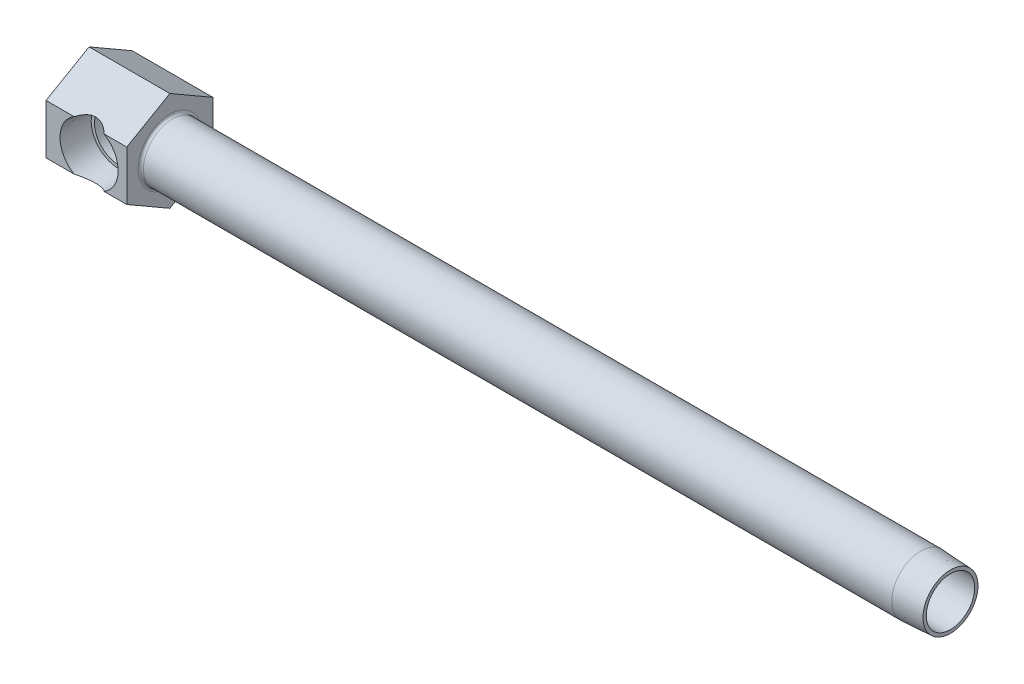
ISO-10303-21;
HEADER;
FILE_DESCRIPTION(('STEP AP214'),'2;1');
FILE_NAME('part.step','',(''),(''),'','','');
FILE_SCHEMA(('AUTOMOTIVE_DESIGN { 1 0 10303 214 1 1 1 1 }'));
ENDSEC;
DATA;
#1=APPLICATION_CONTEXT('core data for automotive mechanical design processes');
#2=APPLICATION_PROTOCOL_DEFINITION('international standard','automotive_design',2000,#1);
#3=PRODUCT_CONTEXT('',#1,'mechanical');
#4=PRODUCT('Part','Part','',(#3));
#5=PRODUCT_RELATED_PRODUCT_CATEGORY('part','',(#4));
#6=PRODUCT_DEFINITION_FORMATION('','',#4);
#7=PRODUCT_DEFINITION_CONTEXT('part definition',#1,'design');
#8=PRODUCT_DEFINITION('design','',#6,#7);
#9=PRODUCT_DEFINITION_SHAPE('','',#8);
#10=(LENGTH_UNIT() NAMED_UNIT(*) SI_UNIT(.MILLI.,.METRE.));
#11=(NAMED_UNIT(*) PLANE_ANGLE_UNIT() SI_UNIT($,.RADIAN.));
#12=(NAMED_UNIT(*) SI_UNIT($,.STERADIAN.) SOLID_ANGLE_UNIT());
#13=UNCERTAINTY_MEASURE_WITH_UNIT(LENGTH_MEASURE(1.E-05),#10,'distance_accuracy_value','');
#14=(GEOMETRIC_REPRESENTATION_CONTEXT(3) GLOBAL_UNCERTAINTY_ASSIGNED_CONTEXT((#13)) GLOBAL_UNIT_ASSIGNED_CONTEXT((#10,
#11,#12)) REPRESENTATION_CONTEXT('',''));
#15=CARTESIAN_POINT('',(0.,0.,0.));
#16=DIRECTION('',(0.,0.,1.));
#17=DIRECTION('',(1.,0.,0.));
#18=AXIS2_PLACEMENT_3D('',#15,#16,#17);
#19=CARTESIAN_POINT('',(254.,0.,12.7));
#20=DIRECTION('',(-1.,0.,0.));
#21=DIRECTION('',(0.,-1.,0.));
#22=AXIS2_PLACEMENT_3D('',#19,#20,#21);
#23=CYLINDRICAL_SURFACE('',#22,8.5725);
#24=CARTESIAN_POINT('',(24.5999,0.,12.7));
#25=DIRECTION('',(-1.,0.,0.));
#26=DIRECTION('',(0.,-1.,0.));
#27=AXIS2_PLACEMENT_3D('',#24,#25,#26);
#28=CIRCLE('',#27,8.5725);
#29=CARTESIAN_POINT('',(24.5999,-8.57249999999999,12.7));
#30=VERTEX_POINT('',#29);
#31=EDGE_CURVE('E283',#30,#30,#28,.F.);
#32=ORIENTED_EDGE('',*,*,#31,.T.);
#33=EDGE_LOOP('',(#32));
#34=FACE_BOUND('',#33,.T.);
#35=CARTESIAN_POINT('',(245.262399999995,0.,12.7000000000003));
#36=DIRECTION('',(-1.,0.,0.));
#37=DIRECTION('',(0.,0.,1.));
#38=AXIS2_PLACEMENT_3D('',#35,#36,#37);
#39=CIRCLE('',#38,8.5725);
#40=CARTESIAN_POINT('',(245.262399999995,0.,21.2725000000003));
#41=VERTEX_POINT('',#40);
#42=EDGE_CURVE('E137',#41,#41,#39,.T.);
#43=ORIENTED_EDGE('',*,*,#42,.T.);
#44=EDGE_LOOP('',(#43));
#45=FACE_BOUND('',#44,.T.);
#46=ADVANCED_FACE('F15',(#34,#45),#23,.T.);
#47=CARTESIAN_POINT('',(23.8125,14.6646968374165,12.7));
#48=DIRECTION('',(0.,-0.866025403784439,-0.5));
#49=DIRECTION('',(0.,0.5,-0.866025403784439));
#50=AXIS2_PLACEMENT_3D('',#47,#48,#49);
#51=PLANE('',#50);
#52=CARTESIAN_POINT('',(12.7,-0.84553451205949,39.56450873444));
#53=DIRECTION('',(0.,-0.866025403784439,-0.5));
#54=DIRECTION('',(0.,-0.5,0.866025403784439));
#55=AXIS2_PLACEMENT_3D('',#52,#53,#54);
#56=ELLIPSE('',#55,18.6296608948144,9.27637524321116);
#57=CARTESIAN_POINT('',(17.1412186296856,7.33234841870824,25.4));
#58=VERTEX_POINT('',#57);
#59=CARTESIAN_POINT('',(8.25878137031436,7.33234841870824,25.4));
#60=VERTEX_POINT('',#59);
#61=EDGE_CURVE('E255',#58,#60,#56,.F.);
#62=ORIENTED_EDGE('',*,*,#61,.F.);
#63=DIRECTION('',(-1.,0.,0.));
#64=VECTOR('',#63,1.);
#65=CARTESIAN_POINT('',(23.8125,7.33234841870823,25.4));
#66=LINE('',#65,#64);
#67=CARTESIAN_POINT('',(23.8125,7.33234841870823,25.4));
#68=VERTEX_POINT('',#67);
#69=EDGE_CURVE('E275',#68,#58,#66,.T.);
#70=ORIENTED_EDGE('',*,*,#69,.F.);
#71=DIRECTION('',(0.,-0.5,0.866025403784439));
#72=VECTOR('',#71,1.);
#73=CARTESIAN_POINT('',(23.8125,14.6646968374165,12.7));
#74=LINE('',#73,#72);
#75=CARTESIAN_POINT('',(23.8125,14.6646968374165,12.7));
#76=VERTEX_POINT('',#75);
#77=EDGE_CURVE('E259',#76,#68,#74,.T.);
#78=ORIENTED_EDGE('',*,*,#77,.F.);
#79=DIRECTION('',(-1.,0.,0.));
#80=VECTOR('',#79,1.);
#81=CARTESIAN_POINT('',(23.8125,14.6646968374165,12.7));
#82=LINE('',#81,#80);
#83=CARTESIAN_POINT('',(0.,14.6646968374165,12.7));
#84=VERTEX_POINT('',#83);
#85=EDGE_CURVE('E231',#76,#84,#82,.T.);
#86=ORIENTED_EDGE('',*,*,#85,.T.);
#87=DIRECTION('',(0.,-0.5,0.866025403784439));
#88=VECTOR('',#87,1.);
#89=CARTESIAN_POINT('',(0.,14.6646968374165,12.7));
#90=LINE('',#89,#88);
#91=CARTESIAN_POINT('',(0.,7.33234841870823,25.4));
#92=VERTEX_POINT('',#91);
#93=EDGE_CURVE('E236',#84,#92,#90,.T.);
#94=ORIENTED_EDGE('',*,*,#93,.T.);
#95=EDGE_CURVE('E274',#60,#92,#66,.T.);
#96=ORIENTED_EDGE('',*,*,#95,.F.);
#97=EDGE_LOOP('',(#62,#70,#78,#86,#94,#96));
#98=FACE_BOUND('',#97,.T.);
#99=ADVANCED_FACE('F172',(#98),#51,.F.);
#100=CARTESIAN_POINT('',(23.8125,7.33234841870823,25.4));
#101=DIRECTION('',(0.,0.,-1.));
#102=DIRECTION('',(-1.,0.,0.));
#103=AXIS2_PLACEMENT_3D('',#100,#101,#102);
#104=PLANE('',#103);
#105=CARTESIAN_POINT('',(12.7,0.,25.4));
#106=DIRECTION('',(0.,0.,-1.));
#107=DIRECTION('',(-1.,0.,0.));
#108=AXIS2_PLACEMENT_3D('',#105,#106,#107);
#109=CIRCLE('',#108,8.5725);
#110=CARTESIAN_POINT('',(17.1412186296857,-7.33234841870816,25.4));
#111=VERTEX_POINT('',#110);
#112=EDGE_CURVE('E284',#58,#111,#109,.T.);
#113=ORIENTED_EDGE('',*,*,#112,.T.);
#114=DIRECTION('',(-1.,0.,0.));
#115=VECTOR('',#114,1.);
#116=CARTESIAN_POINT('',(23.8125,-7.33234841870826,25.4));
#117=LINE('',#116,#115);
#118=CARTESIAN_POINT('',(23.8125,-7.33234841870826,25.4));
#119=VERTEX_POINT('',#118);
#120=EDGE_CURVE('E271',#119,#111,#117,.T.);
#121=ORIENTED_EDGE('',*,*,#120,.F.);
#122=DIRECTION('',(0.,-1.,0.));
#123=VECTOR('',#122,1.);
#124=CARTESIAN_POINT('',(23.8125,7.33234841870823,25.4));
#125=LINE('',#124,#123);
#126=EDGE_CURVE('E261',#68,#119,#125,.T.);
#127=ORIENTED_EDGE('',*,*,#126,.F.);
#128=ORIENTED_EDGE('',*,*,#69,.T.);
#129=EDGE_LOOP('',(#113,#121,#127,#128));
#130=FACE_BOUND('',#129,.T.);
#131=ADVANCED_FACE('F179',(#130),#104,.F.);
#132=CARTESIAN_POINT('',(8.25878137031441,-7.33234841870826,25.4));
#133=VERTEX_POINT('',#132);
#134=EDGE_CURVE('E38',#133,#60,#109,.T.);
#135=ORIENTED_EDGE('',*,*,#134,.T.);
#136=ORIENTED_EDGE('',*,*,#95,.T.);
#137=DIRECTION('',(0.,-1.,0.));
#138=VECTOR('',#137,1.);
#139=CARTESIAN_POINT('',(0.,7.33234841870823,25.4));
#140=LINE('',#139,#138);
#141=CARTESIAN_POINT('',(0.,-7.33234841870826,25.4));
#142=VERTEX_POINT('',#141);
#143=EDGE_CURVE('E242',#92,#142,#140,.T.);
#144=ORIENTED_EDGE('',*,*,#143,.T.);
#145=EDGE_CURVE('E270',#133,#142,#117,.T.);
#146=ORIENTED_EDGE('',*,*,#145,.F.);
#147=EDGE_LOOP('',(#135,#136,#144,#146));
#148=FACE_BOUND('',#147,.T.);
#149=ADVANCED_FACE('F198',(#148),#104,.F.);
#150=CARTESIAN_POINT('',(23.8125,-7.33234841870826,25.4));
#151=DIRECTION('',(0.,0.86602540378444,-0.5));
#152=DIRECTION('',(0.,0.5,0.86602540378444));
#153=AXIS2_PLACEMENT_3D('',#150,#151,#152);
#154=PLANE('',#153);
#155=CARTESIAN_POINT('',(12.7,0.845534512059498,39.5645087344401));
#156=DIRECTION('',(0.,0.86602540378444,-0.5));
#157=DIRECTION('',(0.,0.5,0.86602540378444));
#158=AXIS2_PLACEMENT_3D('',#155,#156,#157);
#159=ELLIPSE('',#158,18.6296608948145,9.27637524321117);
#160=EDGE_CURVE('E23',#133,#111,#159,.F.);
#161=ORIENTED_EDGE('',*,*,#160,.F.);
#162=ORIENTED_EDGE('',*,*,#145,.T.);
#163=DIRECTION('',(0.,-0.5,-0.86602540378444));
#164=VECTOR('',#163,1.);
#165=CARTESIAN_POINT('',(0.,-7.33234841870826,25.4));
#166=LINE('',#165,#164);
#167=CARTESIAN_POINT('',(0.,-14.6646968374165,12.7));
#168=VERTEX_POINT('',#167);
#169=EDGE_CURVE('E249',#142,#168,#166,.T.);
#170=ORIENTED_EDGE('',*,*,#169,.T.);
#171=DIRECTION('',(-1.,0.,0.));
#172=VECTOR('',#171,1.);
#173=CARTESIAN_POINT('',(23.8125,-14.6646968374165,12.7));
#174=LINE('',#173,#172);
#175=CARTESIAN_POINT('',(23.8125,-14.6646968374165,12.7));
#176=VERTEX_POINT('',#175);
#177=EDGE_CURVE('E265',#176,#168,#174,.T.);
#178=ORIENTED_EDGE('',*,*,#177,.F.);
#179=DIRECTION('',(0.,-0.5,-0.86602540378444));
#180=VECTOR('',#179,1.);
#181=CARTESIAN_POINT('',(23.8125,-7.33234841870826,25.4));
#182=LINE('',#181,#180);
#183=EDGE_CURVE('E263',#119,#176,#182,.T.);
#184=ORIENTED_EDGE('',*,*,#183,.F.);
#185=ORIENTED_EDGE('',*,*,#120,.T.);
#186=EDGE_LOOP('',(#161,#162,#170,#178,#184,#185));
#187=FACE_BOUND('',#186,.T.);
#188=ADVANCED_FACE('F195',(#187),#154,.F.);
#189=CARTESIAN_POINT('',(23.8125,-14.6646968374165,12.7));
#190=DIRECTION('',(0.,0.866025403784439,0.5));
#191=DIRECTION('',(0.,-0.5,0.866025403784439));
#192=AXIS2_PLACEMENT_3D('',#189,#190,#191);
#193=PLANE('',#192);
#194=DIRECTION('',(0.,0.5,-0.866025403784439));
#195=VECTOR('',#194,1.);
#196=CARTESIAN_POINT('',(0.,-14.6646968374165,12.7));
#197=LINE('',#196,#195);
#198=CARTESIAN_POINT('',(0.,-7.33234841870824,0.));
#199=VERTEX_POINT('',#198);
#200=EDGE_CURVE('E226',#168,#199,#197,.T.);
#201=ORIENTED_EDGE('',*,*,#200,.T.);
#202=DIRECTION('',(-1.,0.,0.));
#203=VECTOR('',#202,1.);
#204=CARTESIAN_POINT('',(23.8125,-7.33234841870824,0.));
#205=LINE('',#204,#203);
#206=CARTESIAN_POINT('',(23.8125,-7.33234841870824,0.));
#207=VERTEX_POINT('',#206);
#208=EDGE_CURVE('E220',#207,#199,#205,.T.);
#209=ORIENTED_EDGE('',*,*,#208,.F.);
#210=DIRECTION('',(0.,0.5,-0.866025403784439));
#211=VECTOR('',#210,1.);
#212=CARTESIAN_POINT('',(23.8125,-14.6646968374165,12.7));
#213=LINE('',#212,#211);
#214=EDGE_CURVE('E252',#176,#207,#213,.T.);
#215=ORIENTED_EDGE('',*,*,#214,.F.);
#216=ORIENTED_EDGE('',*,*,#177,.T.);
#217=EDGE_LOOP('',(#201,#209,#215,#216));
#218=FACE_BOUND('',#217,.T.);
#219=ADVANCED_FACE('F17',(#218),#193,.F.);
#220=CARTESIAN_POINT('',(23.8125,-7.33234841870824,0.));
#221=DIRECTION('',(0.,0.,1.));
#222=DIRECTION('',(0.,-1.,0.));
#223=AXIS2_PLACEMENT_3D('',#220,#221,#222);
#224=PLANE('',#223);
#225=DIRECTION('',(0.,1.,0.));
#226=VECTOR('',#225,1.);
#227=CARTESIAN_POINT('',(0.,-7.33234841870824,0.));
#228=LINE('',#227,#226);
#229=CARTESIAN_POINT('',(0.,7.33234841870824,0.));
#230=VERTEX_POINT('',#229);
#231=EDGE_CURVE('E215',#199,#230,#228,.T.);
#232=ORIENTED_EDGE('',*,*,#231,.T.);
#233=DIRECTION('',(-1.,0.,0.));
#234=VECTOR('',#233,1.);
#235=CARTESIAN_POINT('',(23.8125,7.33234841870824,0.));
#236=LINE('',#235,#234);
#237=CARTESIAN_POINT('',(23.8125,7.33234841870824,0.));
#238=VERTEX_POINT('',#237);
#239=EDGE_CURVE('E217',#238,#230,#236,.T.);
#240=ORIENTED_EDGE('',*,*,#239,.F.);
#241=DIRECTION('',(0.,1.,0.));
#242=VECTOR('',#241,1.);
#243=CARTESIAN_POINT('',(23.8125,-7.33234841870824,0.));
#244=LINE('',#243,#242);
#245=EDGE_CURVE('E256',#207,#238,#244,.T.);
#246=ORIENTED_EDGE('',*,*,#245,.F.);
#247=ORIENTED_EDGE('',*,*,#208,.T.);
#248=EDGE_LOOP('',(#232,#240,#246,#247));
#249=FACE_BOUND('',#248,.T.);
#250=ADVANCED_FACE('F204',(#249),#224,.F.);
#251=CARTESIAN_POINT('',(23.8125,7.33234841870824,0.));
#252=DIRECTION('',(0.,-0.866025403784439,0.5));
#253=DIRECTION('',(0.,-0.5,-0.866025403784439));
#254=AXIS2_PLACEMENT_3D('',#251,#252,#253);
#255=PLANE('',#254);
#256=DIRECTION('',(0.,0.5,0.866025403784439));
#257=VECTOR('',#256,1.);
#258=CARTESIAN_POINT('',(0.,7.33234841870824,0.));
#259=LINE('',#258,#257);
#260=EDGE_CURVE('E225',#230,#84,#259,.T.);
#261=ORIENTED_EDGE('',*,*,#260,.T.);
#262=ORIENTED_EDGE('',*,*,#85,.F.);
#263=DIRECTION('',(0.,0.5,0.866025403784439));
#264=VECTOR('',#263,1.);
#265=CARTESIAN_POINT('',(23.8125,7.33234841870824,0.));
#266=LINE('',#265,#264);
#267=EDGE_CURVE('E230',#238,#76,#266,.T.);
#268=ORIENTED_EDGE('',*,*,#267,.F.);
#269=ORIENTED_EDGE('',*,*,#239,.T.);
#270=EDGE_LOOP('',(#261,#262,#268,#269));
#271=FACE_BOUND('',#270,.T.);
#272=ADVANCED_FACE('F193',(#271),#255,.F.);
#273=CARTESIAN_POINT('',(23.8125,-21.9970452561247,25.4));
#274=DIRECTION('',(-1.,0.,0.));
#275=DIRECTION('',(0.,-1.,0.));
#276=AXIS2_PLACEMENT_3D('',#273,#274,#275);
#277=PLANE('',#276);
#278=CARTESIAN_POINT('',(23.8125,0.,12.7));
#279=DIRECTION('',(-1.,0.,0.));
#280=DIRECTION('',(0.,-1.,0.));
#281=AXIS2_PLACEMENT_3D('',#278,#279,#280);
#282=CIRCLE('',#281,9.3599);
#283=CARTESIAN_POINT('',(23.8125,-9.35989999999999,12.7));
#284=VERTEX_POINT('',#283);
#285=EDGE_CURVE('E280',#284,#284,#282,.T.);
#286=ORIENTED_EDGE('',*,*,#285,.T.);
#287=EDGE_LOOP('',(#286));
#288=FACE_BOUND('',#287,.T.);
#289=ORIENTED_EDGE('',*,*,#214,.T.);
#290=ORIENTED_EDGE('',*,*,#245,.T.);
#291=ORIENTED_EDGE('',*,*,#267,.T.);
#292=ORIENTED_EDGE('',*,*,#77,.T.);
#293=ORIENTED_EDGE('',*,*,#126,.T.);
#294=ORIENTED_EDGE('',*,*,#183,.T.);
#295=EDGE_LOOP('',(#289,#290,#291,#292,#293,#294));
#296=FACE_BOUND('',#295,.T.);
#297=ADVANCED_FACE('F189',(#288,#296),#277,.F.);
#298=CARTESIAN_POINT('',(0.,-21.9970452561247,25.4));
#299=DIRECTION('',(-1.,0.,0.));
#300=DIRECTION('',(0.,-1.,0.));
#301=AXIS2_PLACEMENT_3D('',#298,#299,#300);
#302=PLANE('',#301);
#303=ORIENTED_EDGE('',*,*,#200,.F.);
#304=ORIENTED_EDGE('',*,*,#169,.F.);
#305=ORIENTED_EDGE('',*,*,#143,.F.);
#306=ORIENTED_EDGE('',*,*,#93,.F.);
#307=ORIENTED_EDGE('',*,*,#260,.F.);
#308=ORIENTED_EDGE('',*,*,#231,.F.);
#309=EDGE_LOOP('',(#303,#304,#305,#306,#307,#308));
#310=FACE_BOUND('',#309,.T.);
#311=ADVANCED_FACE('F186',(#310),#302,.T.);
#312=CARTESIAN_POINT('',(24.5999,0.,12.7));
#313=DIRECTION('',(-1.,0.,0.));
#314=DIRECTION('',(0.,-1.,0.));
#315=AXIS2_PLACEMENT_3D('',#312,#313,#314);
#316=TOROIDAL_SURFACE('',#315,9.3599,0.7874);
#317=ORIENTED_EDGE('',*,*,#31,.F.);
#318=EDGE_LOOP('',(#317));
#319=FACE_BOUND('',#318,.T.);
#320=ORIENTED_EDGE('',*,*,#285,.F.);
#321=EDGE_LOOP('',(#320));
#322=FACE_BOUND('',#321,.T.);
#323=ADVANCED_FACE('F169',(#319,#322),#316,.F.);
#324=CARTESIAN_POINT('',(12.7,0.,25.4));
#325=DIRECTION('',(0.,0.,1.));
#326=DIRECTION('',(1.,0.,0.));
#327=AXIS2_PLACEMENT_3D('',#324,#325,#326);
#328=CONICAL_SURFACE('',#327,8.5725,0.0523598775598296);
#329=CARTESIAN_POINT('',(18.2237788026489,-5.94425228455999,16.6622));
#330=CARTESIAN_POINT('',(18.2916176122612,-5.88732299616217,16.7476009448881));
#331=CARTESIAN_POINT('',(18.3592795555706,-5.82850059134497,16.8318676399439));
#332=CARTESIAN_POINT('',(18.4939968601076,-5.70702027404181,16.9981035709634));
#333=CARTESIAN_POINT('',(18.5610521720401,-5.64436205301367,17.0800726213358));
#334=CARTESIAN_POINT('',(18.761107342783,-5.45038497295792,17.3227058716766));
#335=CARTESIAN_POINT('',(18.8927964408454,-5.31322998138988,17.479846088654));
#336=CARTESIAN_POINT('',(19.1518580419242,-5.02164477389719,17.785397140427));
#337=CARTESIAN_POINT('',(19.2791735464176,-4.86705413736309,17.933703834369));
#338=CARTESIAN_POINT('',(19.5257752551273,-4.54169302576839,18.2184184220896));
#339=CARTESIAN_POINT('',(19.6450670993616,-4.37093412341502,18.35483469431));
#340=CARTESIAN_POINT('',(19.9295445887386,-3.9249765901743,18.6779693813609));
#341=CARTESIAN_POINT('',(20.0885588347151,-3.63961711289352,18.8565618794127));
#342=CARTESIAN_POINT('',(20.3031266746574,-3.18637161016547,19.0960411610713));
#343=CARTESIAN_POINT('',(20.3705741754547,-3.03133869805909,19.1710418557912));
#344=CARTESIAN_POINT('',(20.4965477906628,-2.71316594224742,19.3107517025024));
#345=CARTESIAN_POINT('',(20.5550753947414,-2.5500274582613,19.3754625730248));
#346=CARTESIAN_POINT('',(20.6538405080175,-2.24208944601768,19.4844409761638));
#347=CARTESIAN_POINT('',(20.6955064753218,-2.09831594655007,19.5303217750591));
#348=CARTESIAN_POINT('',(20.7709604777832,-1.80624508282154,19.6132970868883));
#349=CARTESIAN_POINT('',(20.8047499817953,-1.65794856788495,19.6503932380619));
#350=CARTESIAN_POINT('',(20.8638747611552,-1.35762804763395,19.7152415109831));
#351=CARTESIAN_POINT('',(20.8892082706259,-1.20560327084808,19.7429916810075));
#352=CARTESIAN_POINT('',(20.9309344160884,-0.898862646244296,19.7886706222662));
#353=CARTESIAN_POINT('',(20.9473269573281,-0.744146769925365,19.8065992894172));
#354=CARTESIAN_POINT('',(20.9708773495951,-0.432705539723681,19.8323499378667));
#355=CARTESIAN_POINT('',(20.9780075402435,-0.275975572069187,19.8401416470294));
#356=CARTESIAN_POINT('',(20.9827943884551,0.0378027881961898,19.8453730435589));
#357=CARTESIAN_POINT('',(20.9804510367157,0.194851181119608,19.8428127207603));
#358=CARTESIAN_POINT('',(20.9663398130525,0.508011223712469,19.8273884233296));
#359=CARTESIAN_POINT('',(20.9545719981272,0.664122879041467,19.8145245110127));
#360=CARTESIAN_POINT('',(20.9218545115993,0.974205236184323,19.77873224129));
#361=CARTESIAN_POINT('',(20.9009049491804,1.12817596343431,19.755804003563));
#362=CARTESIAN_POINT('',(20.8514678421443,1.42545941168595,19.701637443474));
#363=CARTESIAN_POINT('',(20.8233975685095,1.56892578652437,19.670858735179));
#364=CARTESIAN_POINT('',(20.7597875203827,1.8521546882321,19.6010144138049));
#365=CARTESIAN_POINT('',(20.7242449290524,1.99191579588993,19.5619456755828));
#366=CARTESIAN_POINT('',(20.6072066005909,2.40450989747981,19.4330773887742));
#367=CARTESIAN_POINT('',(20.5152596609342,2.67089071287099,19.3315714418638));
#368=CARTESIAN_POINT('',(20.3408066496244,3.10208873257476,19.1379689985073));
#369=CARTESIAN_POINT('',(20.2643220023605,3.27264094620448,19.0528363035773));
#370=CARTESIAN_POINT('',(20.1020422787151,3.60309741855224,18.8714152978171));
#371=CARTESIAN_POINT('',(20.0162439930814,3.76299797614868,18.7751231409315));
#372=CARTESIAN_POINT('',(19.7465644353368,4.22699236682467,18.4708514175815));
#373=CARTESIAN_POINT('',(19.550728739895,4.51459085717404,18.2478400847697));
#374=CARTESIAN_POINT('',(19.2565333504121,4.89305951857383,17.9071622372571));
#375=CARTESIAN_POINT('',(19.1663785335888,5.00247887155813,17.8020703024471));
#376=CARTESIAN_POINT('',(18.9830153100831,5.21324568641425,17.5865045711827));
#377=CARTESIAN_POINT('',(18.8898069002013,5.31459313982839,17.4760307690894));
#378=CARTESIAN_POINT('',(18.7018932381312,5.50848003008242,17.2510129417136));
#379=CARTESIAN_POINT('',(18.6072061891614,5.60108407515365,17.1365090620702));
#380=CARTESIAN_POINT('',(18.4163909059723,5.77848578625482,16.9028222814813));
#381=CARTESIAN_POINT('',(18.320263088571,5.86328566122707,16.783640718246));
#382=CARTESIAN_POINT('',(18.2237788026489,5.94425228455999,16.6622));
#383=B_SPLINE_CURVE_WITH_KNOTS('',3,(#329,#330,#331,#332,#333,#334,#335,#336,#337,#338,#339,
#340,#341,#342,#343,#344,#345,#346,#347,#348,#349,#350,#351,#352,#353,#354,#355,#356,#357,#358,
#359,#360,#361,#362,#363,#364,#365,#366,#367,#368,#369,#370,#371,#372,#373,#374,#375,#376,#377,
#378,#379,#380,#381,#382),.UNSPECIFIED.,.F.,.F.,(4,2,2,2,2,2,2,2,2,2,2,2,2,2,2,2,2,2,2,2,2,2,2,
2,2,2,4),(0.,0.369050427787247,0.738130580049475,1.47737063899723,2.22407355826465,
2.97024599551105,4.0822255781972,4.63656388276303,5.19080950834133,5.66002823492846,
6.12915938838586,6.59838844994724,7.06762248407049,7.53825460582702,8.00888718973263,
8.47951692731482,8.95014106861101,9.39782196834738,9.84567193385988,10.7406458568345,
11.3560801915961,11.9717272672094,13.2057730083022,13.7350494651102,14.2643264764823,
14.7893227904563,15.3141700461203),.UNSPECIFIED.);
#384=CARTESIAN_POINT('',(18.2239376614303,-5.9441189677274,16.6624));
#385=VERTEX_POINT('',#384);
#386=CARTESIAN_POINT('',(18.2239376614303,5.9441189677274,16.6624));
#387=VERTEX_POINT('',#386);
#388=EDGE_CURVE('E130',#385,#387,#383,.T.);
#389=ORIENTED_EDGE('',*,*,#388,.F.);
#390=CARTESIAN_POINT('',(12.7,0.,16.6624));
#391=DIRECTION('',(0.,0.,-1.));
#392=DIRECTION('',(-1.,0.,0.));
#393=AXIS2_PLACEMENT_3D('',#390,#391,#392);
#394=CIRCLE('',#393,8.1145817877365);
#395=EDGE_CURVE('E292',#385,#387,#394,.T.);
#396=ORIENTED_EDGE('',*,*,#395,.T.);
#397=EDGE_LOOP('',(#389,#396));
#398=FACE_BOUND('',#397,.T.);
#399=ORIENTED_EDGE('',*,*,#61,.T.);
#400=ORIENTED_EDGE('',*,*,#134,.F.);
#401=ORIENTED_EDGE('',*,*,#160,.T.);
#402=ORIENTED_EDGE('',*,*,#112,.F.);
#403=EDGE_LOOP('',(#399,#400,#401,#402));
#404=FACE_BOUND('',#403,.T.);
#405=ADVANCED_FACE('F139',(#398,#404),#328,.F.);
#406=CARTESIAN_POINT('',(20.8145817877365,0.,16.6624));
#407=DIRECTION('',(0.,0.,1.));
#408=DIRECTION('',(1.,0.,0.));
#409=AXIS2_PLACEMENT_3D('',#406,#407,#408);
#410=PLANE('',#409);
#411=DIRECTION('',(1.,0.,0.));
#412=VECTOR('',#411,1.);
#413=CARTESIAN_POINT('',(66.667520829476,-5.9441189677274,16.6624));
#414=LINE('',#413,#412);
#415=CARTESIAN_POINT('',(16.6624,-5.9441189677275,16.6624));
#416=VERTEX_POINT('',#415);
#417=EDGE_CURVE('E125',#416,#385,#414,.T.);
#418=ORIENTED_EDGE('',*,*,#417,.F.);
#419=CARTESIAN_POINT('',(12.7,0.,16.6624));
#420=DIRECTION('',(0.,0.,-1.));
#421=DIRECTION('',(-1.,0.,0.));
#422=AXIS2_PLACEMENT_3D('',#419,#420,#421);
#423=CIRCLE('',#422,7.14375);
#424=CARTESIAN_POINT('',(16.6624,5.9441189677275,16.6624));
#425=VERTEX_POINT('',#424);
#426=EDGE_CURVE('E121',#416,#425,#423,.T.);
#427=ORIENTED_EDGE('',*,*,#426,.T.);
#428=DIRECTION('',(1.,0.,0.));
#429=VECTOR('',#428,1.);
#430=CARTESIAN_POINT('',(66.667520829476,5.9441189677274,16.6624));
#431=LINE('',#430,#429);
#432=EDGE_CURVE('E122',#387,#425,#431,.F.);
#433=ORIENTED_EDGE('',*,*,#432,.F.);
#434=ORIENTED_EDGE('',*,*,#395,.F.);
#435=EDGE_LOOP('',(#418,#427,#433,#434));
#436=FACE_BOUND('',#435,.T.);
#437=ADVANCED_FACE('F161',(#436),#410,.T.);
#438=CARTESIAN_POINT('',(12.7,0.,34.595573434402));
#439=DIRECTION('',(0.,0.,-1.));
#440=DIRECTION('',(-1.,0.,0.));
#441=AXIS2_PLACEMENT_3D('',#438,#439,#440);
#442=CYLINDRICAL_SURFACE('',#441,7.14375);
#443=CARTESIAN_POINT('',(12.7,0.,12.7));
#444=DIRECTION('',(0.707106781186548,0.,-0.707106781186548));
#445=DIRECTION('',(-0.707106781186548,0.,-0.707106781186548));
#446=AXIS2_PLACEMENT_3D('',#443,#444,#445);
#447=ELLIPSE('',#446,10.1027881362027,7.14375);
#448=CARTESIAN_POINT('',(12.7,7.14375,12.7));
#449=VERTEX_POINT('',#448);
#450=EDGE_CURVE('E123',#425,#449,#447,.F.);
#451=ORIENTED_EDGE('',*,*,#450,.F.);
#452=ORIENTED_EDGE('',*,*,#426,.F.);
#453=CARTESIAN_POINT('',(12.7,-7.14375,12.7));
#454=VERTEX_POINT('',#453);
#455=EDGE_CURVE('E110',#454,#416,#447,.F.);
#456=ORIENTED_EDGE('',*,*,#455,.F.);
#457=CARTESIAN_POINT('',(12.7,0.,12.7));
#458=DIRECTION('',(-0.707106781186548,0.,-0.707106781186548));
#459=DIRECTION('',(0.707106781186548,0.,-0.707106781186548));
#460=AXIS2_PLACEMENT_3D('',#457,#458,#459);
#461=ELLIPSE('',#460,10.1027881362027,7.14375);
#462=CARTESIAN_POINT('',(18.1005540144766,-4.67623570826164,7.2994459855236));
#463=VERTEX_POINT('',#462);
#464=EDGE_CURVE('E106',#463,#454,#461,.T.);
#465=ORIENTED_EDGE('',*,*,#464,.F.);
#466=CARTESIAN_POINT('',(12.7,0.,7.2994459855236));
#467=DIRECTION('',(0.,0.,-1.));
#468=DIRECTION('',(-1.,0.,0.));
#469=AXIS2_PLACEMENT_3D('',#466,#467,#468);
#470=CIRCLE('',#469,7.14375);
#471=CARTESIAN_POINT('',(18.1005540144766,4.67623570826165,7.2994459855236));
#472=VERTEX_POINT('',#471);
#473=EDGE_CURVE('E540',#463,#472,#470,.T.);
#474=ORIENTED_EDGE('',*,*,#473,.T.);
#475=EDGE_CURVE('E30',#449,#472,#461,.T.);
#476=ORIENTED_EDGE('',*,*,#475,.F.);
#477=EDGE_LOOP('',(#451,#452,#456,#465,#474,#476));
#478=FACE_BOUND('',#477,.T.);
#479=ADVANCED_FACE('F119',(#478),#442,.F.);
#480=CARTESIAN_POINT('',(12.7,0.,7.2994459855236));
#481=DIRECTION('',(0.,0.,1.));
#482=DIRECTION('',(1.,0.,0.));
#483=AXIS2_PLACEMENT_3D('',#480,#481,#482);
#484=CONICAL_SURFACE('',#483,7.14375,1.0471975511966);
#485=CARTESIAN_POINT('',(18.1008122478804,4.67646667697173,7.29964598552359));
#486=CARTESIAN_POINT('',(18.0182484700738,4.602631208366,7.23572166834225));
#487=CARTESIAN_POINT('',(17.9383238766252,4.5257185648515,7.17175555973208));
#488=CARTESIAN_POINT('',(17.7848563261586,4.3651802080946,7.04412286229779));
#489=CARTESIAN_POINT('',(17.7113260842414,4.28154172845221,6.9804570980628));
#490=CARTESIAN_POINT('',(17.5726476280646,4.10798559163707,6.85457473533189));
#491=CARTESIAN_POINT('',(17.5074361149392,4.01812452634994,6.79235056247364));
#492=CARTESIAN_POINT('',(17.3859720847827,3.83151153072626,6.66964834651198));
#493=CARTESIAN_POINT('',(17.3297132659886,3.7347645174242,6.60916909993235));
#494=CARTESIAN_POINT('',(17.2264163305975,3.53345239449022,6.49019348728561));
#495=CARTESIAN_POINT('',(17.1794940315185,3.42880893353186,6.43172867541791));
#496=CARTESIAN_POINT('',(17.0960237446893,3.21346156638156,6.31865082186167));
#497=CARTESIAN_POINT('',(17.0594774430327,3.10275667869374,6.26403840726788));
#498=CARTESIAN_POINT('',(16.996254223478,2.87633249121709,6.15970832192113));
#499=CARTESIAN_POINT('',(16.9695794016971,2.76061213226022,6.10999169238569));
#500=CARTESIAN_POINT('',(16.9248366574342,2.52527852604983,6.01627423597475));
#501=CARTESIAN_POINT('',(16.9067703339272,2.40566455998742,5.97227447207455));
#502=CARTESIAN_POINT('',(16.8721502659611,2.11917129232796,5.87557836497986));
#503=CARTESIAN_POINT('',(16.8585719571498,1.95102064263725,5.82559588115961));
#504=CARTESIAN_POINT('',(16.8395248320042,1.61106163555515,5.73806695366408));
#505=CARTESIAN_POINT('',(16.834060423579,1.43925134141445,5.70052727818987));
#506=CARTESIAN_POINT('',(16.8272216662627,1.0927248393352,5.63811598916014));
#507=CARTESIAN_POINT('',(16.8258602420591,0.918001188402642,5.61328461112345));
#508=CARTESIAN_POINT('',(16.8244844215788,0.567245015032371,5.57662390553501));
#509=CARTESIAN_POINT('',(16.8244696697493,0.391212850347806,5.56479114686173));
#510=CARTESIAN_POINT('',(16.8244315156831,0.0298631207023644,5.55391234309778));
#511=CARTESIAN_POINT('',(16.8244077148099,-0.155475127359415,5.55554105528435));
#512=CARTESIAN_POINT('',(16.8245481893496,-0.525517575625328,5.57319743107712));
#513=CARTESIAN_POINT('',(16.8247125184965,-0.710221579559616,5.58922920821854));
#514=CARTESIAN_POINT('',(16.8272365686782,-1.07761401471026,5.63557061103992));
#515=CARTESIAN_POINT('',(16.8295939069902,-1.26030441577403,5.6658647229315));
#516=CARTESIAN_POINT('',(16.8402108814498,-1.62260116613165,5.74051131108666));
#517=CARTESIAN_POINT('',(16.8484676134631,-1.80220898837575,5.78485686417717));
#518=CARTESIAN_POINT('',(16.8713785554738,-2.09762253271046,5.87004472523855));
#519=CARTESIAN_POINT('',(16.8829850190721,-2.21474934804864,5.90713222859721));
#520=CARTESIAN_POINT('',(16.912730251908,-2.44618190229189,5.98700326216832));
#521=CARTESIAN_POINT('',(16.9308663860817,-2.56048875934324,6.02978449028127));
#522=CARTESIAN_POINT('',(16.975092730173,-2.78506409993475,6.12039584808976));
#523=CARTESIAN_POINT('',(17.0011553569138,-2.89534512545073,6.16820809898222));
#524=CARTESIAN_POINT('',(17.0623258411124,-3.11130073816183,6.26827147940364));
#525=CARTESIAN_POINT('',(17.0974329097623,-3.21697572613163,6.32052222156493));
#526=CARTESIAN_POINT('',(17.1773511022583,-3.4234009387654,6.42886299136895));
#527=CARTESIAN_POINT('',(17.2222166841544,-3.52411947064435,6.48497330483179));
#528=CARTESIAN_POINT('',(17.3212699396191,-3.71931545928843,6.59977977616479));
#529=CARTESIAN_POINT('',(17.3754591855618,-3.81379185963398,6.65847636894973));
#530=CARTESIAN_POINT('',(17.4924791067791,-3.99641031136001,6.77768652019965));
#531=CARTESIAN_POINT('',(17.5553313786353,-4.0845356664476,6.83820431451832));
#532=CARTESIAN_POINT('',(17.6884734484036,-4.25426378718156,6.96019752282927));
#533=CARTESIAN_POINT('',(17.758764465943,-4.33586547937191,7.02167309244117));
#534=CARTESIAN_POINT('',(17.8750599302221,-4.46018946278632,7.11938400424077));
#535=CARTESIAN_POINT('',(17.9190095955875,-4.50496925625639,7.15548532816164));
#536=CARTESIAN_POINT('',(18.0086324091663,-4.59230195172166,7.22760435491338));
#537=CARTESIAN_POINT('',(18.0542970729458,-4.63486382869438,7.26362172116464));
#538=CARTESIAN_POINT('',(18.1008122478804,-4.67646667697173,7.29964598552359));
#539=B_SPLINE_CURVE_WITH_KNOTS('',3,(#485,#486,#487,#488,#489,#490,#491,#492,#493,#494,#495,
#496,#497,#498,#499,#500,#501,#502,#503,#504,#505,#506,#507,#508,#509,#510,#511,#512,#513,#514,
#515,#516,#517,#518,#519,#520,#521,#522,#523,#524,#525,#526,#527,#528,#529,#530,#531,#532,#533,
#534,#535,#536,#537,#538),.UNSPECIFIED.,.F.,.F.,(4,2,2,2,2,2,2,2,2,2,2,2,2,2,2,2,2,2,2,2,2,2,2,
2,2,2,4),(0.,0.383734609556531,0.768215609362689,1.14957007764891,1.530654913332,
1.91620690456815,2.30182151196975,2.68751795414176,3.07328600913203,3.60029069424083,
4.12758157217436,4.65653172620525,5.18534222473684,5.74081422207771,6.29644491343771,
6.85147261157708,7.40622727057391,7.77616444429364,8.14595249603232,8.51446817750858,
8.88295172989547,9.25354694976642,9.62420472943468,9.99580384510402,10.367463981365,
10.5845818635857,10.8007392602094),.UNSPECIFIED.);
#540=EDGE_CURVE('E112',#472,#463,#539,.T.);
#541=ORIENTED_EDGE('',*,*,#540,.F.);
#542=ORIENTED_EDGE('',*,*,#473,.F.);
#543=EDGE_LOOP('',(#541,#542));
#544=FACE_BOUND('',#543,.T.);
#545=CARTESIAN_POINT('',(12.7,0.,3.1750000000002));
#546=VERTEX_POINT('',#545);
#547=VERTEX_LOOP('',#546);
#548=FACE_BOUND('',#547,.T.);
#549=ADVANCED_FACE('F155',(#544,#548),#484,.F.);
#550=CARTESIAN_POINT('',(64.0369909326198,0.,12.7));
#551=DIRECTION('',(-1.,0.,0.));
#552=DIRECTION('',(0.,0.,1.));
#553=AXIS2_PLACEMENT_3D('',#550,#551,#552);
#554=CONICAL_SURFACE('',#553,18.0701212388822,0.0523598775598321);
#555=CARTESIAN_POINT('',(254.,3.264272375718E-13,12.7));
#556=DIRECTION('',(-1.,0.,0.));
#557=DIRECTION('',(0.,-1.,0.));
#558=AXIS2_PLACEMENT_3D('',#555,#556,#557);
#559=CIRCLE('',#558,8.11458178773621);
#560=CARTESIAN_POINT('',(254.,-8.11458178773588,12.7));
#561=VERTEX_POINT('',#560);
#562=EDGE_CURVE('E10',#561,#561,#559,.T.);
#563=ORIENTED_EDGE('',*,*,#562,.T.);
#564=EDGE_LOOP('',(#563));
#565=FACE_BOUND('',#564,.T.);
#566=ORIENTED_EDGE('',*,*,#42,.F.);
#567=EDGE_LOOP('',(#566));
#568=FACE_BOUND('',#567,.T.);
#569=ADVANCED_FACE('F147',(#565,#568),#554,.T.);
#570=CARTESIAN_POINT('',(254.,0.,12.7));
#571=DIRECTION('',(-1.,0.,0.));
#572=DIRECTION('',(0.,-1.,0.));
#573=AXIS2_PLACEMENT_3D('',#570,#571,#572);
#574=PLANE('',#573);
#575=CARTESIAN_POINT('',(254.,0.,12.7));
#576=DIRECTION('',(1.,0.,0.));
#577=DIRECTION('',(0.,0.,-1.));
#578=AXIS2_PLACEMENT_3D('',#575,#576,#577);
#579=CIRCLE('',#578,7.14374999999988);
#580=CARTESIAN_POINT('',(254.,0.,5.55625000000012));
#581=VERTEX_POINT('',#580);
#582=EDGE_CURVE('E154',#581,#581,#579,.T.);
#583=ORIENTED_EDGE('',*,*,#582,.F.);
#584=EDGE_LOOP('',(#583));
#585=FACE_BOUND('',#584,.T.);
#586=ORIENTED_EDGE('',*,*,#562,.F.);
#587=EDGE_LOOP('',(#586));
#588=FACE_BOUND('',#587,.T.);
#589=ADVANCED_FACE('F146',(#585,#588),#574,.F.);
#590=CARTESIAN_POINT('',(66.667520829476,0.,12.7));
#591=DIRECTION('',(1.,0.,0.));
#592=DIRECTION('',(0.,0.,-1.));
#593=AXIS2_PLACEMENT_3D('',#590,#591,#592);
#594=CYLINDRICAL_SURFACE('',#593,7.14374999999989);
#595=ORIENTED_EDGE('',*,*,#388,.T.);
#596=ORIENTED_EDGE('',*,*,#432,.T.);
#597=ORIENTED_EDGE('',*,*,#450,.T.);
#598=ORIENTED_EDGE('',*,*,#475,.T.);
#599=ORIENTED_EDGE('',*,*,#540,.T.);
#600=ORIENTED_EDGE('',*,*,#464,.T.);
#601=ORIENTED_EDGE('',*,*,#455,.T.);
#602=ORIENTED_EDGE('',*,*,#417,.T.);
#603=EDGE_LOOP('',(#595,#596,#597,#598,#599,#600,#601,#602));
#604=FACE_BOUND('',#603,.T.);
#605=ORIENTED_EDGE('',*,*,#582,.T.);
#606=EDGE_LOOP('',(#605));
#607=FACE_BOUND('',#606,.T.);
#608=ADVANCED_FACE('F108',(#604,#607),#594,.F.);
#609=CLOSED_SHELL('',(#46,#99,#131,#149,#188,#219,#250,#272,#297,#311,#323,#405,#437,#479,#549,
#569,#589,#608));
#610=MANIFOLD_SOLID_BREP('B1',#609);
#611=ADVANCED_BREP_SHAPE_REPRESENTATION('',(#18,#610),#14);
#612=SHAPE_DEFINITION_REPRESENTATION(#9,#611);
ENDSEC;
END-ISO-10303-21;
